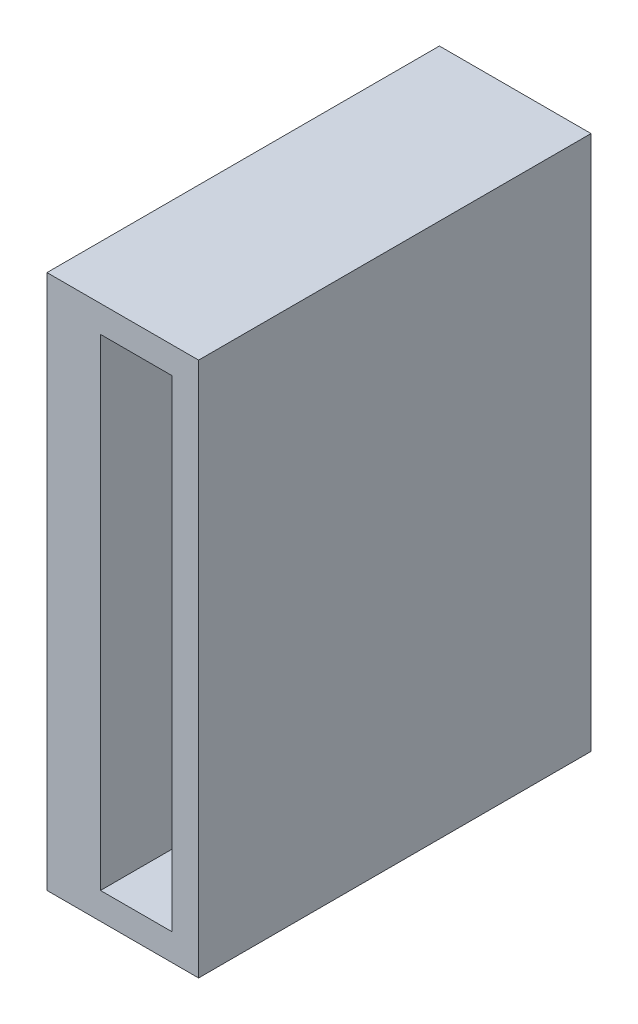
from build123d import *

# Parameters (mm, degrees)
CROQUIS1_W              = 3
CROQUIS1_H              = 26
SALIENTE_EXTRUIR1_DEPTH = 30
CROQUIS5_W              = 8.5
CROQUIS5_H              = 30
CROQUIS5_W_2            = 4
CROQUIS5_H_2            = 27
SALIENTE_EXTRUIR3_DEPTH = 22
CROQUIS6_W              = 4
CROQUIS6_H              = 27
CORTAR_EXTRUIR2_DEPTH   = 39.18665536
CROQUIS7_W              = 2
CROQUIS7_H              = 20
CORTAR_EXTRUIR3_DEPTH   = 21


with BuildPart() as part:
    # Croquis1 → Saliente-Extruir1 (new body)
    with BuildSketch(Plane.XY):
        with Locations((-3.166492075, -7.170454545)):
            Rectangle(CROQUIS1_W, CROQUIS1_H)
    extrude(amount=SALIENTE_EXTRUIR1_DEPTH)

    # Croquis6 → Cortar-Extruir2 (cut, through all)
    with BuildSketch(Plane(origin=(0, 0, 0), x_dir=(-1, 0, 0), z_dir=(0, 0, -1))):
        with Locations((3.166492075, -7.170454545)):
            Rectangle(CROQUIS6_W, CROQUIS6_H)
    extrude(amount=-CORTAR_EXTRUIR2_DEPTH, mode=Mode.SUBTRACT)


with BuildPart() as body_2:
    # Croquis5 → Saliente-Extruir3 (new body)
    with BuildSketch(Plane(origin=(0, 0, 0), x_dir=(-1, 0, 0), z_dir=(0, 0, -1))):
        with Locations((3.916492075, -7.170454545)):
            Rectangle(CROQUIS5_W, CROQUIS5_H)
        with Locations((3.166492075, -7.170454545)):
            Rectangle(CROQUIS5_W_2, CROQUIS5_H_2, mode=Mode.SUBTRACT)
    extrude(amount=-SALIENTE_EXTRUIR3_DEPTH)

    # Croquis7 → Cortar-Extruir3 (cut)
    with BuildSketch(Plane(origin=(0, 0, 0), x_dir=(-1, 0, 0), z_dir=(0, 0, -1))):
        with Locations((6.666492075, -7.170454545)):
            Rectangle(CROQUIS7_W, CROQUIS7_H)
    extrude(amount=-CORTAR_EXTRUIR3_DEPTH, mode=Mode.SUBTRACT)


solid = body_2.part
